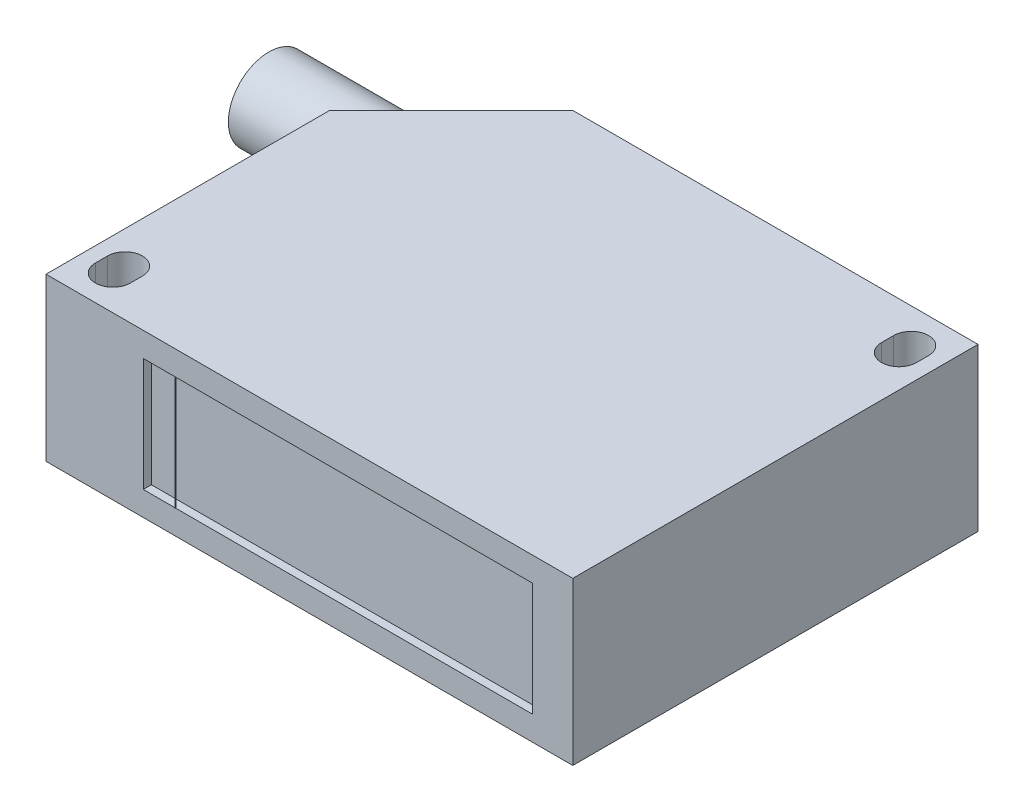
from build123d import *

# Parameters (mm, degrees)
SKETCH2_W           = 65
SKETCH2_H           = 50
BOSS_EXTRUDE1_DEPTH = 10
SKETCH4_W           = 48
SKETCH4_H           = 14
CUT_EXTRUDE1_DEPTH  = 1
CUT_EXTRUDE2_DEPTH  = 46.620718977
CUT_EXTRUDE3_DEPTH  = 46.620718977
SKETCH11_W          = 0.01
SKETCH11_H          = 14
BOSS_EXTRUDE4_DEPTH = 0.1
BOSS_EXTRUDE5_REACH = 86.439
SKETCH12_R          = 5


with BuildPart() as part:
    # Sketch2 → Boss-Extrude1 (new, symmetric)
    with BuildSketch(Plane(origin=(0, 0, 0), x_dir=(1, 0, 0), z_dir=(0, 1, 0))):
        Rectangle(SKETCH2_W, SKETCH2_H)
    extrude(amount=BOSS_EXTRUDE1_DEPTH, both=True)

    # Sketch4 → Cut-Extrude1 (cut)
    with BuildSketch(Plane.XY.offset(25)):
        with Locations((3.5, 0)):
            Rectangle(SKETCH4_W, SKETCH4_H)
    extrude(amount=-CUT_EXTRUDE1_DEPTH, mode=Mode.SUBTRACT)

    # Sketch5 → Cut-Extrude2 (cut, through all)
    with BuildSketch(Plane.XZ.offset(10)):
        with BuildLine():
            Line((-30.65, 19.25), (-30.65, 20.75))
            ThreePointArc((-30.65, 20.75), (-28.5, 22.9), (-26.35, 20.75))
            Line((-26.35, 20.75), (-26.35, 19.25))
            ThreePointArc((-26.35, 19.25), (-28.5, 17.1), (-30.65, 19.25))
        make_face()
        with BuildLine():
            Line((26.35, -20.75), (26.35, -19.25))
            ThreePointArc((26.35, -19.25), (28.5, -17.1), (30.65, -19.25))
            Line((30.65, -19.25), (30.65, -20.75))
            ThreePointArc((30.65, -20.75), (28.5, -22.9), (26.35, -20.75))
        make_face()
    extrude(amount=-CUT_EXTRUDE2_DEPTH, mode=Mode.SUBTRACT)

    # Sketch8 → Cut-Extrude3 (cut, through all)
    with BuildSketch(Plane.XZ.offset(10)):
        Polygon((-32.5, -10), (-17.5, -25), (-32.5, -25), align=None)
    extrude(amount=-CUT_EXTRUDE3_DEPTH, mode=Mode.SUBTRACT)

    # Boss-Extrude5: up to this plane
    boss_extrude5_end = Plane(origin=(-32.5, 10, -10), z_dir=(0.7071067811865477, 0, 0.7071067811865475))
    # Sketch12 → Boss-Extrude5 (add, up to the surface)
    with BuildSketch(Plane.ZY.offset(47.5), mode=Mode.PRIVATE) as boss_extrude5_sk1:
        with Locations((-17.5, 0)):
            Circle(SKETCH12_R)
    boss_extrude5_tool1 = split(extrude(boss_extrude5_sk1.sketch, amount=-BOSS_EXTRUDE5_REACH, mode=Mode.PRIVATE), bisect_by=boss_extrude5_end, keep=Keep.BOTH, mode=Mode.PRIVATE)
    add(boss_extrude5_tool1.solids().sort_by_distance((-47.5, 0, -17.5))[0])


with BuildPart() as body_2:
    # Sketch11 → Boss-Extrude4 (new body)
    with BuildSketch(Plane.XY.offset(25)):
        with Locations((-16.495, 0)):
            Rectangle(SKETCH11_W, SKETCH11_H)
    extrude(amount=BOSS_EXTRUDE4_DEPTH)


solid = Compound([part.part, body_2.part])
